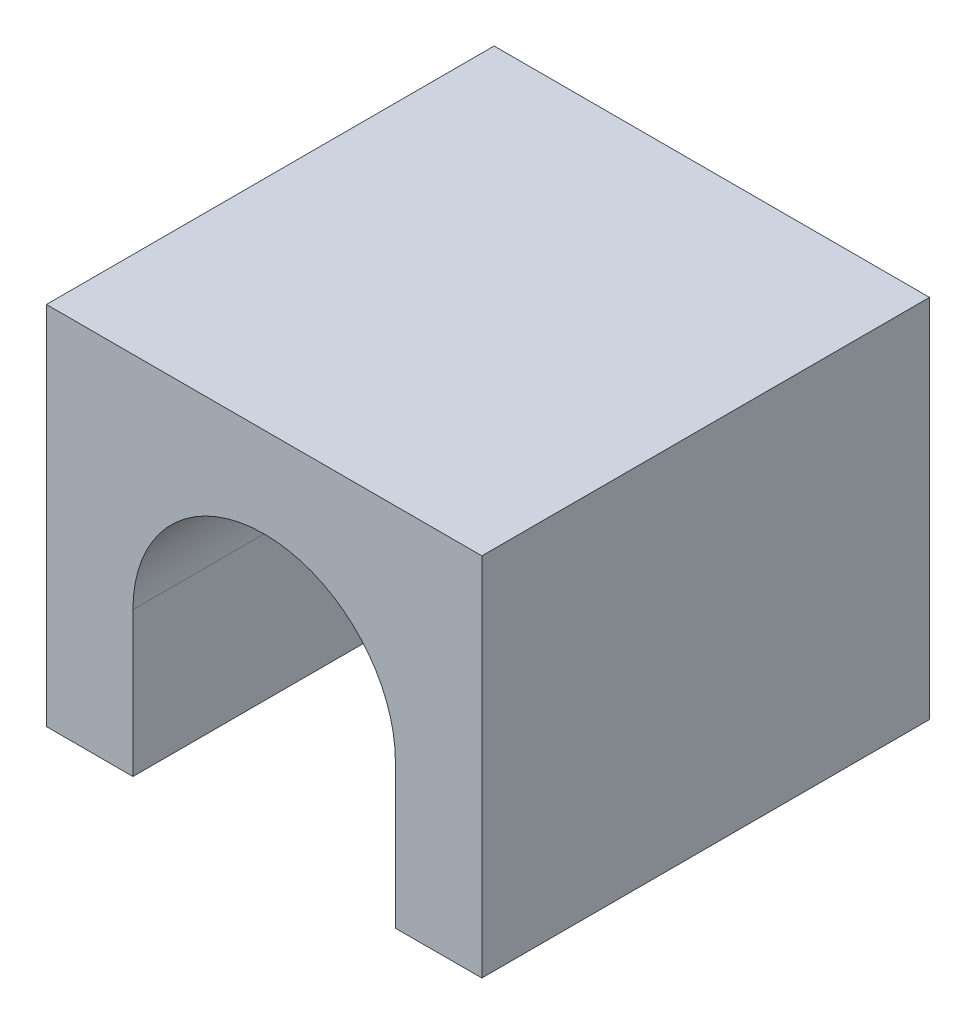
from build123d import *

# Parameters (mm, degrees)
BOSS_EXTRUDE1_DEPTH = 19
BOSS_EXTRUDE2_DEPTH = 39


with BuildPart() as part:
    # Sketch1 → Boss-Extrude1 (new body)
    with BuildSketch(Plane.XY):
        with BuildLine():
            Line((4.077435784, -26.551928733), (14.011010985, -26.51155062))
            Line((14.011010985, -26.51155062), (14.011010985, 20.853010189))
            Line((14.011010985, 20.853010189), (-42.400841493, 20.853010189))
            Line((-42.400841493, 20.853010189), (-42.400841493, -26.51155062))
            Line((-42.400841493, -26.51155062), (-32.400841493, -26.51155062))
            Line((-32.400841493, -26.51155062), (-33.334724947, -7.786016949))
            ThreePointArc((-33.334724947, -7.786016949), (-14.661856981, 10.853010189), (4.011010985, -7.786016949))
            Line((4.011010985, -7.786016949), (4.011010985, -26.51155062))
            Line((4.011010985, -26.51155062), (4.077435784, -26.551928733))
        make_face()
    extrude(amount=BOSS_EXTRUDE1_DEPTH)

    # Sketch2 → Boss-Extrude2 (add)
    with BuildSketch(Plane.XY.offset(19)):
        with BuildLine():
            Line((-31.194915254, -7.786016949), (-31.194915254, -24.786016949))
            Line((-31.194915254, -24.786016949), (-31.194915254, -26.51155062))
            Line((-31.194915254, -26.51155062), (-42.400841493, -26.51155062))
            Line((-42.400841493, -26.51155062), (-42.400841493, 20.853010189))
            Line((-42.400841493, 20.853010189), (14.011010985, 20.853010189))
            Line((14.011010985, 20.853010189), (14.011010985, -26.51155062))
            Line((14.011010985, -26.51155062), (2.805084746, -26.531739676))
            Line((2.805084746, -26.531739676), (2.805084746, -24.786016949))
            Line((2.805084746, -24.786016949), (2.805084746, -7.786016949))
            ThreePointArc((2.805084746, -7.786016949), (-14.194915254, 9.213983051), (-31.194915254, -7.786016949))
        make_face()
    extrude(amount=BOSS_EXTRUDE2_DEPTH)


solid = part.part
